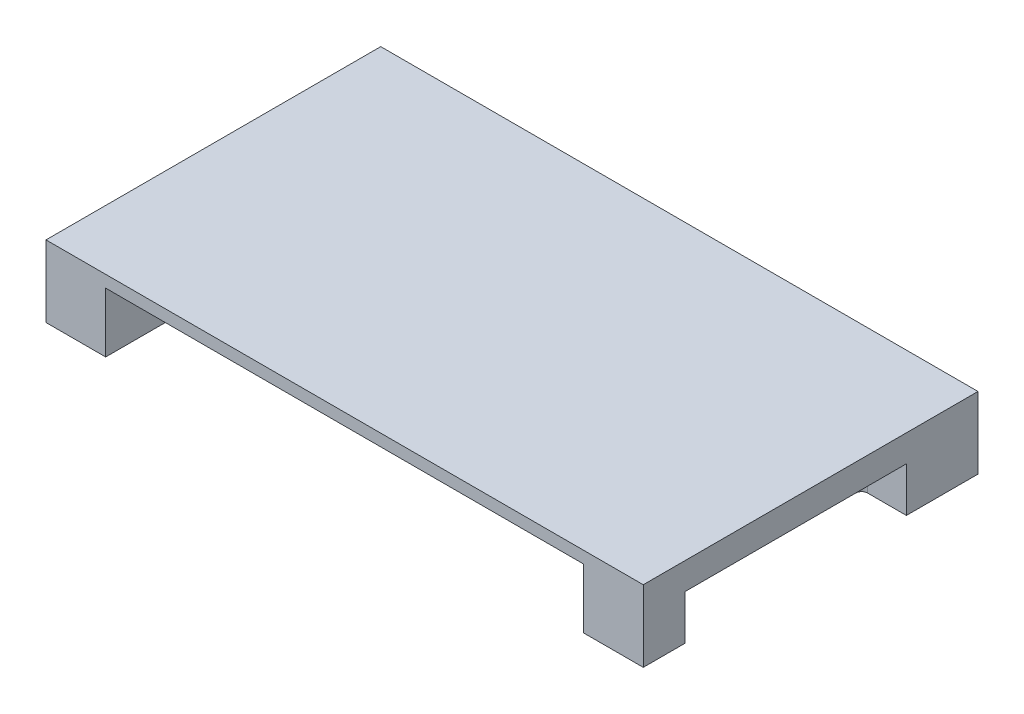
from build123d import *

# Parameters (mm, degrees)
BOSS_EXTRUDE3_DEPTH = 4.5
SKETCH1_3_W         = 80.1
SKETCH1_3_H         = 41.1
SKETCH1_3_H_2       = 10
SKETCH1_3_H_3       = 5
BOSS_EXTRUDE4_DEPTH = 2
BOSS_EXTRUDE5_START = -4.5
BOSS_EXTRUDE5_DEPTH = 7.5
BOSS_EXTRUDE6_START = -12
BOSS_EXTRUDE6_DEPTH = 1


with BuildPart() as part:
    # Sketch1 → Boss-Extrude3 (new body)
    with BuildSketch(Plane(origin=(0, 0, 0), x_dir=(1, 0, 0), z_dir=(0, 1, 0))):
        with BuildLine():
            Line((90.1, 46.1), (90.1, 5))
            Line((90.1, 5), (95.6, 5))
            Line((95.6, 5), (97.1, 5))
            ThreePointArc((97.1, 5), (97.807106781, 4.707106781), (98.1, 4))
            Line((98.1, 4), (98.1, 2.5))
            Line((98.1, 2.5), (98.1, 0))
            Line((98.1, 0), (100.1, 0))
            Line((100.1, 0), (100.1, 7))
            Line((100.1, 7), (93.6, 7))
            ThreePointArc((93.6, 7), (92.892893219, 7.292893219), (92.6, 8))
            Line((92.6, 8), (92.6, 43.1))
            ThreePointArc((92.6, 43.1), (92.892893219, 43.807106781), (93.6, 44.1))
            Line((93.6, 44.1), (100.1, 44.1))
            Line((100.1, 44.1), (100.1, 56.1))
            Line((100.1, 56.1), (98.1, 56.1))
            Line((98.1, 56.1), (98.1, 48.6))
            Line((98.1, 48.6), (98.1, 47.1))
            ThreePointArc((98.1, 47.1), (97.807106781, 46.392893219), (97.1, 46.1))
            Line((97.1, 46.1), (95.6, 46.1))
            Line((95.6, 46.1), (90.1, 46.1))
        make_face()
        with BuildLine():
            Line((0, 7), (0, 0))
            Line((0, 0), (2, 0))
            Line((2, 0), (2, 2.5))
            Line((2, 2.5), (2, 4))
            ThreePointArc((2, 4), (2.292893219, 4.707106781), (3, 5))
            Line((3, 5), (4.5, 5))
            Line((4.5, 5), (10, 5))
            Line((10, 5), (10, 46.1))
            Line((10, 46.1), (4.5, 46.1))
            Line((4.5, 46.1), (3, 46.1))
            ThreePointArc((3, 46.1), (2.292893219, 46.392893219), (2, 47.1))
            Line((2, 47.1), (2, 48.6))
            Line((2, 48.6), (2, 56.1))
            Line((2, 56.1), (0, 56.1))
            Line((0, 56.1), (0, 44.1))
            Line((0, 44.1), (6.5, 44.1))
            ThreePointArc((6.5, 44.1), (7.207106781, 43.807106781), (7.5, 43.1))
            Line((7.5, 43.1), (7.5, 8))
            ThreePointArc((7.5, 8), (7.207106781, 7.292893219), (6.5, 7))
            Line((6.5, 7), (0, 7))
        make_face()
        with BuildLine():
            Line((90.1, 5), (90.1, 0))
            Line((90.1, 0), (98.1, 0))
            Line((98.1, 0), (98.1, 2.5))
            Line((98.1, 2.5), (97.1, 2.5))
            Line((97.1, 2.5), (97.1, 3.5))
            ThreePointArc((97.1, 3.5), (96.953553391, 3.853553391), (96.6, 4))
            Line((96.6, 4), (95.6, 4))
            Line((95.6, 4), (95.6, 5))
            Line((95.6, 5), (90.1, 5))
        make_face()
        with BuildLine():
            ThreePointArc((92.6, 43.1), (92.892893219, 43.807106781), (93.6, 44.1))
            Line((93.6, 44.1), (100.1, 44.1))
            Line((100.1, 44.1), (100.1, 7))
            Line((100.1, 7), (93.6, 7))
            ThreePointArc((93.6, 7), (92.892893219, 7.292893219), (92.6, 8))
            Line((92.6, 8), (92.6, 43.1))
        make_face()
        with BuildLine():
            Line((90.1, 56.1), (90.1, 46.1))
            Line((90.1, 46.1), (95.6, 46.1))
            Line((95.6, 46.1), (95.6, 47.1))
            Line((95.6, 47.1), (96.6, 47.1))
            ThreePointArc((96.6, 47.1), (96.953553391, 47.246446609), (97.1, 47.6))
            Line((97.1, 47.6), (97.1, 48.6))
            Line((97.1, 48.6), (98.1, 48.6))
            Line((98.1, 48.6), (98.1, 56.1))
            Line((98.1, 56.1), (90.1, 56.1))
        make_face()
        with BuildLine():
            Line((97.1, 5), (95.6, 5))
            Line((95.6, 5), (95.6, 4))
            Line((95.6, 4), (96.6, 4))
            ThreePointArc((96.6, 4), (96.953553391, 3.853553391), (97.1, 3.5))
            Line((97.1, 3.5), (97.1, 2.5))
            Line((97.1, 2.5), (98.1, 2.5))
            Line((98.1, 2.5), (98.1, 4))
            ThreePointArc((98.1, 4), (97.807106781, 4.707106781), (97.1, 5))
        make_face()
        with BuildLine():
            Line((95.6, 47.1), (95.6, 46.1))
            Line((95.6, 46.1), (97.1, 46.1))
            ThreePointArc((97.1, 46.1), (97.807106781, 46.392893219), (98.1, 47.1))
            Line((98.1, 47.1), (98.1, 48.6))
            Line((98.1, 48.6), (97.1, 48.6))
            Line((97.1, 48.6), (97.1, 47.6))
            ThreePointArc((97.1, 47.6), (96.953553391, 47.246446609), (96.6, 47.1))
            Line((96.6, 47.1), (95.6, 47.1))
        make_face()
        with BuildLine():
            Line((4.5, 46.1), (10, 46.1))
            Line((10, 46.1), (10, 56.1))
            Line((10, 56.1), (2, 56.1))
            Line((2, 56.1), (2, 48.6))
            Line((2, 48.6), (3, 48.6))
            Line((3, 48.6), (3, 47.6))
            ThreePointArc((3, 47.6), (3.146446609, 47.246446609), (3.5, 47.1))
            Line((3.5, 47.1), (4.5, 47.1))
            Line((4.5, 47.1), (4.5, 46.1))
        make_face()
        with BuildLine():
            Line((3, 46.1), (4.5, 46.1))
            Line((4.5, 46.1), (4.5, 47.1))
            Line((4.5, 47.1), (3.5, 47.1))
            ThreePointArc((3.5, 47.1), (3.146446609, 47.246446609), (3, 47.6))
            Line((3, 47.6), (3, 48.6))
            Line((3, 48.6), (2, 48.6))
            Line((2, 48.6), (2, 47.1))
            ThreePointArc((2, 47.1), (2.292893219, 46.392893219), (3, 46.1))
        make_face()
        with BuildLine():
            ThreePointArc((7.5, 8), (7.207106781, 7.292893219), (6.5, 7))
            Line((6.5, 7), (0, 7))
            Line((0, 7), (0, 44.1))
            Line((0, 44.1), (6.5, 44.1))
            ThreePointArc((6.5, 44.1), (7.207106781, 43.807106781), (7.5, 43.1))
            Line((7.5, 43.1), (7.5, 8))
        make_face()
        with BuildLine():
            Line((2, 2.5), (2, 0))
            Line((2, 0), (10, 0))
            Line((10, 0), (10, 5))
            Line((10, 5), (4.5, 5))
            Line((4.5, 5), (4.5, 4))
            Line((4.5, 4), (3.5, 4))
            ThreePointArc((3.5, 4), (3.146446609, 3.853553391), (3, 3.5))
            Line((3, 3.5), (3, 2.5))
            Line((3, 2.5), (2, 2.5))
        make_face()
        with BuildLine():
            Line((2, 4), (2, 2.5))
            Line((2, 2.5), (3, 2.5))
            Line((3, 2.5), (3, 3.5))
            ThreePointArc((3, 3.5), (3.146446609, 3.853553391), (3.5, 4))
            Line((3.5, 4), (4.5, 4))
            Line((4.5, 4), (4.5, 5))
            Line((4.5, 5), (3, 5))
            ThreePointArc((3, 5), (2.292893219, 4.707106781), (2, 4))
        make_face()
    extrude(amount=-BOSS_EXTRUDE3_DEPTH)

    # Sketch1_3 → Boss-Extrude4 (add)
    with BuildSketch(Plane(origin=(0, 0, 0), x_dir=(1, 0, 0), z_dir=(0, 1, 0))):
        with Locations((50.05, 25.55)):
            Rectangle(SKETCH1_3_W, SKETCH1_3_H)
        with Locations((50.05, 51.1)):
            Rectangle(SKETCH1_3_W, SKETCH1_3_H_2)
        with Locations((50.05, 2.5)):
            Rectangle(SKETCH1_3_W, SKETCH1_3_H_3)
    extrude(amount=-BOSS_EXTRUDE4_DEPTH)

    # Sketch1_4 → Boss-Extrude5 (add)
    with BuildSketch(Plane(origin=(0, 0, 0), x_dir=(1, 0, 0), z_dir=(0, 1, 0)).offset(BOSS_EXTRUDE5_START)):
        with BuildLine():
            Line((97.1, 5), (95.6, 5))
            Line((95.6, 5), (95.6, 4))
            Line((95.6, 4), (96.6, 4))
            ThreePointArc((96.6, 4), (96.953553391, 3.853553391), (97.1, 3.5))
            Line((97.1, 3.5), (97.1, 2.5))
            Line((97.1, 2.5), (98.1, 2.5))
            Line((98.1, 2.5), (98.1, 4))
            ThreePointArc((98.1, 4), (97.807106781, 4.707106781), (97.1, 5))
        make_face()
        with BuildLine():
            Line((95.6, 47.1), (95.6, 46.1))
            Line((95.6, 46.1), (97.1, 46.1))
            ThreePointArc((97.1, 46.1), (97.807106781, 46.392893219), (98.1, 47.1))
            Line((98.1, 47.1), (98.1, 48.6))
            Line((98.1, 48.6), (97.1, 48.6))
            Line((97.1, 48.6), (97.1, 47.6))
            ThreePointArc((97.1, 47.6), (96.953553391, 47.246446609), (96.6, 47.1))
            Line((96.6, 47.1), (95.6, 47.1))
        make_face()
        with BuildLine():
            Line((2, 4), (2, 2.5))
            Line((2, 2.5), (3, 2.5))
            Line((3, 2.5), (3, 3.5))
            ThreePointArc((3, 3.5), (3.146446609, 3.853553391), (3.5, 4))
            Line((3.5, 4), (4.5, 4))
            Line((4.5, 4), (4.5, 5))
            Line((4.5, 5), (3, 5))
            ThreePointArc((3, 5), (2.292893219, 4.707106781), (2, 4))
        make_face()
        with BuildLine():
            Line((3, 46.1), (4.5, 46.1))
            Line((4.5, 46.1), (4.5, 47.1))
            Line((4.5, 47.1), (3.5, 47.1))
            ThreePointArc((3.5, 47.1), (3.146446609, 47.246446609), (3, 47.6))
            Line((3, 47.6), (3, 48.6))
            Line((3, 48.6), (2, 48.6))
            Line((2, 48.6), (2, 47.1))
            ThreePointArc((2, 47.1), (2.292893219, 46.392893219), (3, 46.1))
        make_face()
        with BuildLine():
            Line((4.5, 46.1), (10, 46.1))
            Line((10, 46.1), (10, 56.1))
            Line((10, 56.1), (2, 56.1))
            Line((2, 56.1), (2, 48.6))
            Line((2, 48.6), (3, 48.6))
            Line((3, 48.6), (3, 47.6))
            ThreePointArc((3, 47.6), (3.146446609, 47.246446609), (3.5, 47.1))
            Line((3.5, 47.1), (4.5, 47.1))
            Line((4.5, 47.1), (4.5, 46.1))
        make_face()
        with BuildLine():
            Line((0, 7), (0, 0))
            Line((0, 0), (2, 0))
            Line((2, 0), (2, 2.5))
            Line((2, 2.5), (2, 4))
            ThreePointArc((2, 4), (2.292893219, 4.707106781), (3, 5))
            Line((3, 5), (4.5, 5))
            Line((4.5, 5), (10, 5))
            Line((10, 5), (10, 46.1))
            Line((10, 46.1), (4.5, 46.1))
            Line((4.5, 46.1), (3, 46.1))
            ThreePointArc((3, 46.1), (2.292893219, 46.392893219), (2, 47.1))
            Line((2, 47.1), (2, 48.6))
            Line((2, 48.6), (2, 56.1))
            Line((2, 56.1), (0, 56.1))
            Line((0, 56.1), (0, 44.1))
            Line((0, 44.1), (6.5, 44.1))
            ThreePointArc((6.5, 44.1), (7.207106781, 43.807106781), (7.5, 43.1))
            Line((7.5, 43.1), (7.5, 8))
            ThreePointArc((7.5, 8), (7.207106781, 7.292893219), (6.5, 7))
            Line((6.5, 7), (0, 7))
        make_face()
        with BuildLine():
            Line((2, 2.5), (2, 0))
            Line((2, 0), (10, 0))
            Line((10, 0), (10, 5))
            Line((10, 5), (4.5, 5))
            Line((4.5, 5), (4.5, 4))
            Line((4.5, 4), (3.5, 4))
            ThreePointArc((3.5, 4), (3.146446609, 3.853553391), (3, 3.5))
            Line((3, 3.5), (3, 2.5))
            Line((3, 2.5), (2, 2.5))
        make_face()
        with BuildLine():
            Line((90.1, 56.1), (90.1, 46.1))
            Line((90.1, 46.1), (95.6, 46.1))
            Line((95.6, 46.1), (95.6, 47.1))
            Line((95.6, 47.1), (96.6, 47.1))
            ThreePointArc((96.6, 47.1), (96.953553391, 47.246446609), (97.1, 47.6))
            Line((97.1, 47.6), (97.1, 48.6))
            Line((97.1, 48.6), (98.1, 48.6))
            Line((98.1, 48.6), (98.1, 56.1))
            Line((98.1, 56.1), (90.1, 56.1))
        make_face()
        with BuildLine():
            Line((90.1, 46.1), (90.1, 5))
            Line((90.1, 5), (95.6, 5))
            Line((95.6, 5), (97.1, 5))
            ThreePointArc((97.1, 5), (97.807106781, 4.707106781), (98.1, 4))
            Line((98.1, 4), (98.1, 2.5))
            Line((98.1, 2.5), (98.1, 0))
            Line((98.1, 0), (100.1, 0))
            Line((100.1, 0), (100.1, 7))
            Line((100.1, 7), (93.6, 7))
            ThreePointArc((93.6, 7), (92.892893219, 7.292893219), (92.6, 8))
            Line((92.6, 8), (92.6, 43.1))
            ThreePointArc((92.6, 43.1), (92.892893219, 43.807106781), (93.6, 44.1))
            Line((93.6, 44.1), (100.1, 44.1))
            Line((100.1, 44.1), (100.1, 56.1))
            Line((100.1, 56.1), (98.1, 56.1))
            Line((98.1, 56.1), (98.1, 48.6))
            Line((98.1, 48.6), (98.1, 47.1))
            ThreePointArc((98.1, 47.1), (97.807106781, 46.392893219), (97.1, 46.1))
            Line((97.1, 46.1), (95.6, 46.1))
            Line((95.6, 46.1), (90.1, 46.1))
        make_face()
        with BuildLine():
            Line((90.1, 5), (90.1, 0))
            Line((90.1, 0), (98.1, 0))
            Line((98.1, 0), (98.1, 2.5))
            Line((98.1, 2.5), (97.1, 2.5))
            Line((97.1, 2.5), (97.1, 3.5))
            ThreePointArc((97.1, 3.5), (96.953553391, 3.853553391), (96.6, 4))
            Line((96.6, 4), (95.6, 4))
            Line((95.6, 4), (95.6, 5))
            Line((95.6, 5), (90.1, 5))
        make_face()
    extrude(amount=-BOSS_EXTRUDE5_DEPTH)

    # Sketch1_5 → Boss-Extrude6 (add)
    with BuildSketch(Plane(origin=(0, 0, 0), x_dir=(1, 0, 0), z_dir=(0, 1, 0)).offset(BOSS_EXTRUDE6_START)):
        with BuildLine():
            Line((3, 46.1), (4.5, 46.1))
            Line((4.5, 46.1), (4.5, 47.1))
            Line((4.5, 47.1), (3.5, 47.1))
            ThreePointArc((3.5, 47.1), (3.146446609, 47.246446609), (3, 47.6))
            Line((3, 47.6), (3, 48.6))
            Line((3, 48.6), (2, 48.6))
            Line((2, 48.6), (2, 47.1))
            ThreePointArc((2, 47.1), (2.292893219, 46.392893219), (3, 46.1))
        make_face()
        with BuildLine():
            Line((2, 4), (2, 2.5))
            Line((2, 2.5), (3, 2.5))
            Line((3, 2.5), (3, 3.5))
            ThreePointArc((3, 3.5), (3.146446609, 3.853553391), (3.5, 4))
            Line((3.5, 4), (4.5, 4))
            Line((4.5, 4), (4.5, 5))
            Line((4.5, 5), (3, 5))
            ThreePointArc((3, 5), (2.292893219, 4.707106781), (2, 4))
        make_face()
        with BuildLine():
            Line((97.1, 5), (95.6, 5))
            Line((95.6, 5), (95.6, 4))
            Line((95.6, 4), (96.6, 4))
            ThreePointArc((96.6, 4), (96.953553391, 3.853553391), (97.1, 3.5))
            Line((97.1, 3.5), (97.1, 2.5))
            Line((97.1, 2.5), (98.1, 2.5))
            Line((98.1, 2.5), (98.1, 4))
            ThreePointArc((98.1, 4), (97.807106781, 4.707106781), (97.1, 5))
        make_face()
        with BuildLine():
            Line((95.6, 47.1), (95.6, 46.1))
            Line((95.6, 46.1), (97.1, 46.1))
            ThreePointArc((97.1, 46.1), (97.807106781, 46.392893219), (98.1, 47.1))
            Line((98.1, 47.1), (98.1, 48.6))
            Line((98.1, 48.6), (97.1, 48.6))
            Line((97.1, 48.6), (97.1, 47.6))
            ThreePointArc((97.1, 47.6), (96.953553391, 47.246446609), (96.6, 47.1))
            Line((96.6, 47.1), (95.6, 47.1))
        make_face()
    extrude(amount=-BOSS_EXTRUDE6_DEPTH)


solid = part.part
